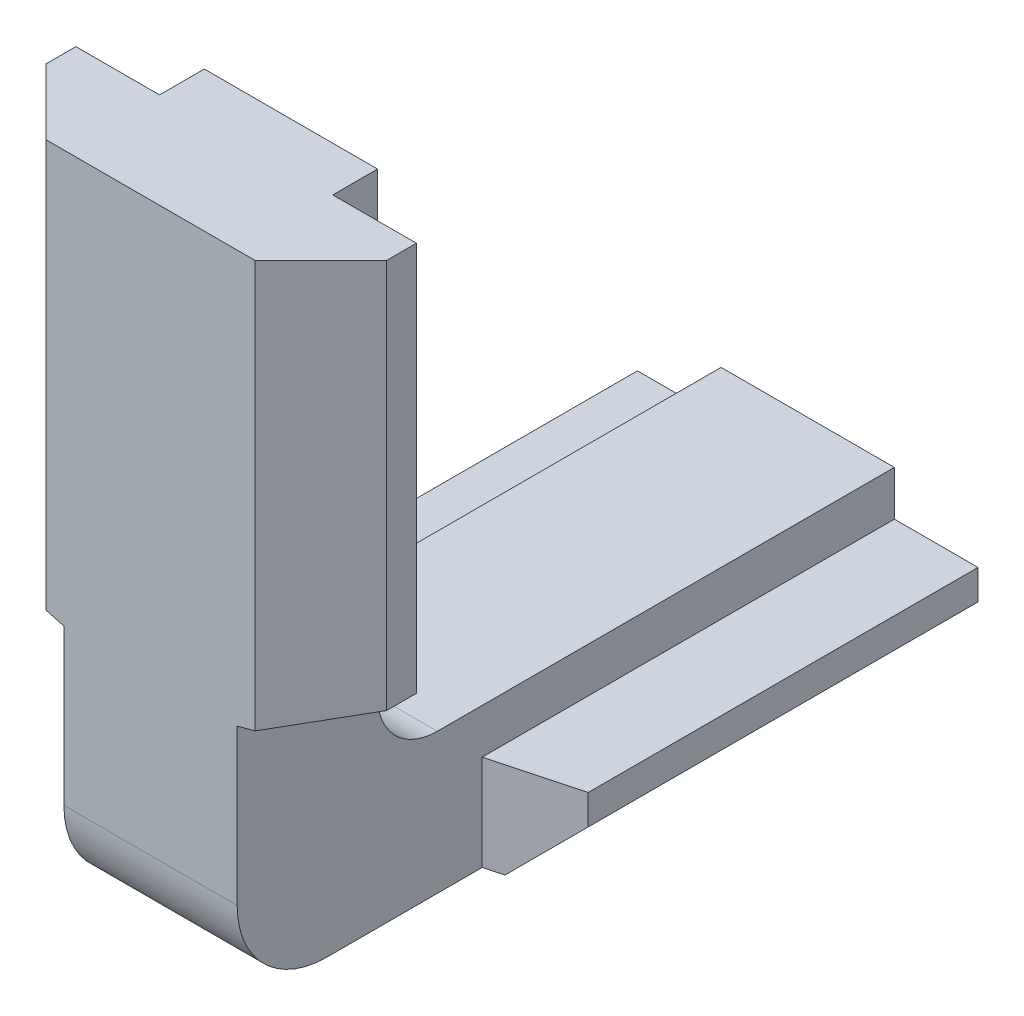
ISO-10303-21;
HEADER;
FILE_DESCRIPTION(('STEP AP214'),'2;1');
FILE_NAME('part.step','',(''),(''),'','','');
FILE_SCHEMA(('AUTOMOTIVE_DESIGN { 1 0 10303 214 1 1 1 1 }'));
ENDSEC;
DATA;
#1=APPLICATION_CONTEXT('core data for automotive mechanical design processes');
#2=APPLICATION_PROTOCOL_DEFINITION('international standard','automotive_design',2000,#1);
#3=PRODUCT_CONTEXT('',#1,'mechanical');
#4=PRODUCT('Part','Part','',(#3));
#5=PRODUCT_RELATED_PRODUCT_CATEGORY('part','',(#4));
#6=PRODUCT_DEFINITION_FORMATION('','',#4);
#7=PRODUCT_DEFINITION_CONTEXT('part definition',#1,'design');
#8=PRODUCT_DEFINITION('design','',#6,#7);
#9=PRODUCT_DEFINITION_SHAPE('','',#8);
#10=(LENGTH_UNIT() NAMED_UNIT(*) SI_UNIT(.MILLI.,.METRE.));
#11=(NAMED_UNIT(*) PLANE_ANGLE_UNIT() SI_UNIT($,.RADIAN.));
#12=(NAMED_UNIT(*) SI_UNIT($,.STERADIAN.) SOLID_ANGLE_UNIT());
#13=UNCERTAINTY_MEASURE_WITH_UNIT(LENGTH_MEASURE(1.E-05),#10,'distance_accuracy_value','');
#14=(GEOMETRIC_REPRESENTATION_CONTEXT(3) GLOBAL_UNCERTAINTY_ASSIGNED_CONTEXT((#13)) GLOBAL_UNIT_ASSIGNED_CONTEXT((#10,
#11,#12)) REPRESENTATION_CONTEXT('',''));
#15=CARTESIAN_POINT('',(0.,0.,0.));
#16=DIRECTION('',(0.,0.,1.));
#17=DIRECTION('',(1.,0.,0.));
#18=AXIS2_PLACEMENT_3D('',#15,#16,#17);
#19=CARTESIAN_POINT('',(5.7,-2.5,-17.3));
#20=DIRECTION('',(1.,0.,0.));
#21=DIRECTION('',(0.,0.,-1.));
#22=AXIS2_PLACEMENT_3D('',#19,#20,#21);
#23=PLANE('',#22);
#24=DIRECTION('',(0.,1.,0.));
#25=VECTOR('',#24,1.);
#26=CARTESIAN_POINT('',(5.7,0.,-17.3));
#27=LINE('',#26,#25);
#28=CARTESIAN_POINT('',(5.7,-2.5,-17.3));
#29=VERTEX_POINT('',#28);
#30=CARTESIAN_POINT('',(5.7,-1.5,-17.3));
#31=VERTEX_POINT('',#30);
#32=EDGE_CURVE('E360',#29,#31,#27,.T.);
#33=ORIENTED_EDGE('',*,*,#32,.T.);
#34=DIRECTION('',(0.,0.,1.));
#35=VECTOR('',#34,1.);
#36=CARTESIAN_POINT('',(5.7,-1.5,-17.3));
#37=LINE('',#36,#35);
#38=CARTESIAN_POINT('',(5.7,-1.5,-4.25026));
#39=VERTEX_POINT('',#38);
#40=EDGE_CURVE('E430',#39,#31,#37,.F.);
#41=ORIENTED_EDGE('',*,*,#40,.F.);
#42=DIRECTION('',(0.,1.,0.));
#43=VECTOR('',#42,1.);
#44=CARTESIAN_POINT('',(5.7,-1.5,-4.25026));
#45=LINE('',#44,#43);
#46=CARTESIAN_POINT('',(5.7,-2.5,-4.25026));
#47=VERTEX_POINT('',#46);
#48=EDGE_CURVE('E350',#39,#47,#45,.F.);
#49=ORIENTED_EDGE('',*,*,#48,.T.);
#50=DIRECTION('',(0.,0.,1.));
#51=VECTOR('',#50,1.);
#52=CARTESIAN_POINT('',(5.7,-2.5,-17.3));
#53=LINE('',#52,#51);
#54=EDGE_CURVE('E421',#29,#47,#53,.T.);
#55=ORIENTED_EDGE('',*,*,#54,.F.);
#56=EDGE_LOOP('',(#33,#41,#49,#55));
#57=FACE_BOUND('',#56,.T.);
#58=ADVANCED_FACE('F16',(#57),#23,.T.);
#59=CARTESIAN_POINT('',(-5.7,-1.5,-17.3));
#60=DIRECTION('',(-1.,0.,0.));
#61=DIRECTION('',(0.,0.,1.));
#62=AXIS2_PLACEMENT_3D('',#59,#60,#61);
#63=PLANE('',#62);
#64=DIRECTION('',(0.,1.,0.));
#65=VECTOR('',#64,1.);
#66=CARTESIAN_POINT('',(-5.7,0.,-17.3));
#67=LINE('',#66,#65);
#68=CARTESIAN_POINT('',(-5.7,-1.5,-17.3));
#69=VERTEX_POINT('',#68);
#70=CARTESIAN_POINT('',(-5.7,-2.5,-17.3));
#71=VERTEX_POINT('',#70);
#72=EDGE_CURVE('E162',#69,#71,#67,.F.);
#73=ORIENTED_EDGE('',*,*,#72,.T.);
#74=DIRECTION('',(0.,0.,1.));
#75=VECTOR('',#74,1.);
#76=CARTESIAN_POINT('',(-5.7,-2.5,-17.3));
#77=LINE('',#76,#75);
#78=CARTESIAN_POINT('',(-5.7,-2.5,-4.25026000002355));
#79=VERTEX_POINT('',#78);
#80=EDGE_CURVE('E357',#79,#71,#77,.F.);
#81=ORIENTED_EDGE('',*,*,#80,.F.);
#82=DIRECTION('',(0.,1.,0.));
#83=VECTOR('',#82,1.);
#84=CARTESIAN_POINT('',(-5.7,-1.5,-4.25026000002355));
#85=LINE('',#84,#83);
#86=CARTESIAN_POINT('',(-5.7,-1.5,-4.25026000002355));
#87=VERTEX_POINT('',#86);
#88=EDGE_CURVE('E361',#79,#87,#85,.T.);
#89=ORIENTED_EDGE('',*,*,#88,.T.);
#90=DIRECTION('',(0.,0.,1.));
#91=VECTOR('',#90,1.);
#92=CARTESIAN_POINT('',(-5.7,-1.5,-17.3));
#93=LINE('',#92,#91);
#94=EDGE_CURVE('E244',#69,#87,#93,.T.);
#95=ORIENTED_EDGE('',*,*,#94,.F.);
#96=EDGE_LOOP('',(#73,#81,#89,#95));
#97=FACE_BOUND('',#96,.T.);
#98=ADVANCED_FACE('F597',(#97),#63,.T.);
#99=CARTESIAN_POINT('',(-5.7,-2.5,-17.3));
#100=DIRECTION('',(-0.707106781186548,-0.707106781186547,0.));
#101=DIRECTION('',(0.707106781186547,-0.707106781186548,0.));
#102=AXIS2_PLACEMENT_3D('',#99,#100,#101);
#103=PLANE('',#102);
#104=DIRECTION('',(0.707106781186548,-0.707106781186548,0.));
#105=VECTOR('',#104,1.);
#106=CARTESIAN_POINT('',(-5.7,-2.5,-17.3));
#107=LINE('',#106,#105);
#108=CARTESIAN_POINT('',(-3.5,-4.7,-17.3));
#109=VERTEX_POINT('',#108);
#110=EDGE_CURVE('E374',#71,#109,#107,.T.);
#111=ORIENTED_EDGE('',*,*,#110,.T.);
#112=DIRECTION('',(0.,0.,-1.));
#113=VECTOR('',#112,1.);
#114=CARTESIAN_POINT('',(-3.5,-4.7,-17.3));
#115=LINE('',#114,#113);
#116=CARTESIAN_POINT('',(-3.5,-4.7,-3.66077000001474));
#117=VERTEX_POINT('',#116);
#118=EDGE_CURVE('E232',#117,#109,#115,.T.);
#119=ORIENTED_EDGE('',*,*,#118,.F.);
#120=DIRECTION('',(-0.694746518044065,0.694746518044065,-0.186157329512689));
#121=VECTOR('',#120,1.);
#122=CARTESIAN_POINT('',(-3.5,-4.7,-3.66077000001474));
#123=LINE('',#122,#121);
#124=EDGE_CURVE('E243',#117,#79,#123,.T.);
#125=ORIENTED_EDGE('',*,*,#124,.T.);
#126=ORIENTED_EDGE('',*,*,#80,.T.);
#127=EDGE_LOOP('',(#111,#119,#125,#126));
#128=FACE_BOUND('',#127,.T.);
#129=ADVANCED_FACE('F595',(#128),#103,.T.);
#130=CARTESIAN_POINT('',(0.,0.,-17.3));
#131=DIRECTION('',(0.,0.,1.));
#132=DIRECTION('',(1.,0.,0.));
#133=AXIS2_PLACEMENT_3D('',#130,#131,#132);
#134=PLANE('',#133);
#135=ORIENTED_EDGE('',*,*,#110,.F.);
#136=ORIENTED_EDGE('',*,*,#72,.F.);
#137=DIRECTION('',(1.,0.,0.));
#138=VECTOR('',#137,1.);
#139=CARTESIAN_POINT('',(-2.9,-1.5,-17.3));
#140=LINE('',#139,#138);
#141=CARTESIAN_POINT('',(-2.9,-1.5,-17.3));
#142=VERTEX_POINT('',#141);
#143=EDGE_CURVE('E160',#142,#69,#140,.F.);
#144=ORIENTED_EDGE('',*,*,#143,.F.);
#145=DIRECTION('',(0.,1.,0.));
#146=VECTOR('',#145,1.);
#147=CARTESIAN_POINT('',(-2.9,0.,-17.3));
#148=LINE('',#147,#146);
#149=CARTESIAN_POINT('',(-2.9,0.,-17.3));
#150=VERTEX_POINT('',#149);
#151=EDGE_CURVE('E150',#150,#142,#148,.F.);
#152=ORIENTED_EDGE('',*,*,#151,.F.);
#153=DIRECTION('',(1.,0.,0.));
#154=VECTOR('',#153,1.);
#155=CARTESIAN_POINT('',(2.9,0.,-17.3));
#156=LINE('',#155,#154);
#157=CARTESIAN_POINT('',(2.9,0.,-17.3));
#158=VERTEX_POINT('',#157);
#159=EDGE_CURVE('E158',#158,#150,#156,.F.);
#160=ORIENTED_EDGE('',*,*,#159,.F.);
#161=DIRECTION('',(0.,1.,0.));
#162=VECTOR('',#161,1.);
#163=CARTESIAN_POINT('',(2.9,0.,-17.3));
#164=LINE('',#163,#162);
#165=CARTESIAN_POINT('',(2.9,-1.5,-17.3));
#166=VERTEX_POINT('',#165);
#167=EDGE_CURVE('E71',#166,#158,#164,.T.);
#168=ORIENTED_EDGE('',*,*,#167,.F.);
#169=DIRECTION('',(1.,0.,0.));
#170=VECTOR('',#169,1.);
#171=CARTESIAN_POINT('',(5.7,-1.5,-17.3));
#172=LINE('',#171,#170);
#173=EDGE_CURVE('E402',#31,#166,#172,.F.);
#174=ORIENTED_EDGE('',*,*,#173,.F.);
#175=ORIENTED_EDGE('',*,*,#32,.F.);
#176=DIRECTION('',(0.707106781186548,0.707106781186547,0.));
#177=VECTOR('',#176,1.);
#178=CARTESIAN_POINT('',(3.5,-4.7,-17.3));
#179=LINE('',#178,#177);
#180=CARTESIAN_POINT('',(3.5,-4.7,-17.3));
#181=VERTEX_POINT('',#180);
#182=EDGE_CURVE('E424',#181,#29,#179,.T.);
#183=ORIENTED_EDGE('',*,*,#182,.F.);
#184=DIRECTION('',(1.,0.,0.));
#185=VECTOR('',#184,1.);
#186=CARTESIAN_POINT('',(-3.5,-4.7,-17.3));
#187=LINE('',#186,#185);
#188=EDGE_CURVE('E344',#109,#181,#187,.T.);
#189=ORIENTED_EDGE('',*,*,#188,.F.);
#190=EDGE_LOOP('',(#135,#136,#144,#152,#160,#168,#174,#175,#183,#189));
#191=FACE_BOUND('',#190,.T.);
#192=ADVANCED_FACE('F157',(#191),#134,.F.);
#193=CARTESIAN_POINT('',(3.5,-4.7,-17.3));
#194=DIRECTION('',(0.707106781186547,-0.707106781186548,0.));
#195=DIRECTION('',(0.707106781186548,0.707106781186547,0.));
#196=AXIS2_PLACEMENT_3D('',#193,#194,#195);
#197=PLANE('',#196);
#198=ORIENTED_EDGE('',*,*,#182,.T.);
#199=ORIENTED_EDGE('',*,*,#54,.T.);
#200=DIRECTION('',(-0.694746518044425,-0.694746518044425,0.186157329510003));
#201=VECTOR('',#200,1.);
#202=CARTESIAN_POINT('',(5.7,-2.5,-4.25026));
#203=LINE('',#202,#201);
#204=CARTESIAN_POINT('',(3.5,-4.7,-3.66077));
#205=VERTEX_POINT('',#204);
#206=EDGE_CURVE('E347',#47,#205,#203,.T.);
#207=ORIENTED_EDGE('',*,*,#206,.T.);
#208=DIRECTION('',(0.,0.,-1.));
#209=VECTOR('',#208,1.);
#210=CARTESIAN_POINT('',(3.5,-4.7,-17.3));
#211=LINE('',#210,#209);
#212=EDGE_CURVE('E213',#181,#205,#211,.F.);
#213=ORIENTED_EDGE('',*,*,#212,.F.);
#214=EDGE_LOOP('',(#198,#199,#207,#213));
#215=FACE_BOUND('',#214,.T.);
#216=ADVANCED_FACE('F588',(#215),#197,.T.);
#217=CARTESIAN_POINT('',(5.7,-1.5,-4.25026));
#218=DIRECTION('',(-0.258819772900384,0.,-0.965925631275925));
#219=DIRECTION('',(-0.965925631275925,0.,0.258819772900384));
#220=AXIS2_PLACEMENT_3D('',#217,#218,#219);
#221=PLANE('',#220);
#222=ORIENTED_EDGE('',*,*,#206,.F.);
#223=ORIENTED_EDGE('',*,*,#48,.F.);
#224=DIRECTION('',(0.965925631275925,0.,-0.258819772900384));
#225=VECTOR('',#224,1.);
#226=CARTESIAN_POINT('',(2.9,-1.5,-3.5));
#227=LINE('',#226,#225);
#228=CARTESIAN_POINT('',(2.9,-1.5,-3.5));
#229=VERTEX_POINT('',#228);
#230=EDGE_CURVE('E349',#229,#39,#227,.T.);
#231=ORIENTED_EDGE('',*,*,#230,.F.);
#232=DIRECTION('',(0.,1.,0.));
#233=VECTOR('',#232,1.);
#234=CARTESIAN_POINT('',(2.9,-1.5,-3.5));
#235=LINE('',#234,#233);
#236=CARTESIAN_POINT('',(2.9,-4.7,-3.5));
#237=VERTEX_POINT('',#236);
#238=EDGE_CURVE('E212',#237,#229,#235,.T.);
#239=ORIENTED_EDGE('',*,*,#238,.F.);
#240=DIRECTION('',(-0.965925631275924,0.,0.258819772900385));
#241=VECTOR('',#240,1.);
#242=CARTESIAN_POINT('',(3.5,-4.7,-3.66077));
#243=LINE('',#242,#241);
#244=EDGE_CURVE('E233',#205,#237,#243,.T.);
#245=ORIENTED_EDGE('',*,*,#244,.F.);
#246=EDGE_LOOP('',(#222,#223,#231,#239,#245));
#247=FACE_BOUND('',#246,.T.);
#248=ADVANCED_FACE('F584',(#247),#221,.F.);
#249=CARTESIAN_POINT('',(5.7,-1.5,-17.3));
#250=DIRECTION('',(0.,1.,0.));
#251=DIRECTION('',(0.,0.,1.));
#252=AXIS2_PLACEMENT_3D('',#249,#250,#251);
#253=PLANE('',#252);
#254=ORIENTED_EDGE('',*,*,#173,.T.);
#255=DIRECTION('',(0.,0.,-1.));
#256=VECTOR('',#255,1.);
#257=CARTESIAN_POINT('',(2.9,-1.5,-17.3));
#258=LINE('',#257,#256);
#259=EDGE_CURVE('E208',#229,#166,#258,.T.);
#260=ORIENTED_EDGE('',*,*,#259,.F.);
#261=ORIENTED_EDGE('',*,*,#230,.T.);
#262=ORIENTED_EDGE('',*,*,#40,.T.);
#263=EDGE_LOOP('',(#254,#260,#261,#262));
#264=FACE_BOUND('',#263,.T.);
#265=ADVANCED_FACE('F581',(#264),#253,.T.);
#266=CARTESIAN_POINT('',(5.7,-2.5,-17.3));
#267=DIRECTION('',(1.,0.,0.));
#268=DIRECTION('',(0.,0.,-1.));
#269=AXIS2_PLACEMENT_3D('',#266,#267,#268);
#270=PLANE('',#269);
#271=DIRECTION('',(0.,1.,0.));
#272=VECTOR('',#271,1.);
#273=CARTESIAN_POINT('',(5.7,-4.7,2.5));
#274=LINE('',#273,#272);
#275=CARTESIAN_POINT('',(5.7,4.25025773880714,2.5));
#276=VERTEX_POINT('',#275);
#277=CARTESIAN_POINT('',(5.7,17.3,2.5));
#278=VERTEX_POINT('',#277);
#279=EDGE_CURVE('E223',#276,#278,#274,.T.);
#280=ORIENTED_EDGE('',*,*,#279,.F.);
#281=DIRECTION('',(0.,0.,1.));
#282=VECTOR('',#281,1.);
#283=CARTESIAN_POINT('',(5.7,4.25025773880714,0.));
#284=LINE('',#283,#282);
#285=CARTESIAN_POINT('',(5.70000000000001,4.25025773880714,1.5));
#286=VERTEX_POINT('',#285);
#287=EDGE_CURVE('E314',#276,#286,#284,.F.);
#288=ORIENTED_EDGE('',*,*,#287,.T.);
#289=DIRECTION('',(0.,1.,0.));
#290=VECTOR('',#289,1.);
#291=CARTESIAN_POINT('',(5.70000000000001,-4.7,1.5));
#292=LINE('',#291,#290);
#293=CARTESIAN_POINT('',(5.70000000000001,17.3,1.5));
#294=VERTEX_POINT('',#293);
#295=EDGE_CURVE('E324',#294,#286,#292,.F.);
#296=ORIENTED_EDGE('',*,*,#295,.F.);
#297=DIRECTION('',(0.,0.,-1.));
#298=VECTOR('',#297,1.);
#299=CARTESIAN_POINT('',(5.7,17.3,-17.3));
#300=LINE('',#299,#298);
#301=EDGE_CURVE('E315',#294,#278,#300,.F.);
#302=ORIENTED_EDGE('',*,*,#301,.T.);
#303=EDGE_LOOP('',(#280,#288,#296,#302));
#304=FACE_BOUND('',#303,.T.);
#305=ADVANCED_FACE('F514',(#304),#270,.T.);
#306=CARTESIAN_POINT('',(2.9,3.5,0.));
#307=DIRECTION('',(-0.258819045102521,0.965925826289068,0.));
#308=DIRECTION('',(-0.965925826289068,-0.258819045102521,0.));
#309=AXIS2_PLACEMENT_3D('',#306,#307,#308);
#310=PLANE('',#309);
#311=DIRECTION('',(-0.965925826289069,-0.258819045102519,0.));
#312=VECTOR('',#311,1.);
#313=CARTESIAN_POINT('',(5.7,4.25025773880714,1.5));
#314=LINE('',#313,#312);
#315=CARTESIAN_POINT('',(2.9,3.5,1.5));
#316=VERTEX_POINT('',#315);
#317=EDGE_CURVE('E285',#286,#316,#314,.T.);
#318=ORIENTED_EDGE('',*,*,#317,.F.);
#319=ORIENTED_EDGE('',*,*,#287,.F.);
#320=DIRECTION('',(0.694746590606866,0.186156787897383,-0.694746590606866));
#321=VECTOR('',#320,1.);
#322=CARTESIAN_POINT('',(3.5,3.66076951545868,4.7));
#323=LINE('',#322,#321);
#324=CARTESIAN_POINT('',(3.5,3.66076951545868,4.7));
#325=VERTEX_POINT('',#324);
#326=EDGE_CURVE('E299',#325,#276,#323,.T.);
#327=ORIENTED_EDGE('',*,*,#326,.F.);
#328=DIRECTION('',(-0.965925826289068,-0.258819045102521,0.));
#329=VECTOR('',#328,1.);
#330=CARTESIAN_POINT('',(2.9,3.5,4.7));
#331=LINE('',#330,#329);
#332=CARTESIAN_POINT('',(2.9,3.5,4.7));
#333=VERTEX_POINT('',#332);
#334=EDGE_CURVE('E117',#333,#325,#331,.F.);
#335=ORIENTED_EDGE('',*,*,#334,.F.);
#336=DIRECTION('',(0.,0.,-1.));
#337=VECTOR('',#336,1.);
#338=CARTESIAN_POINT('',(2.9,3.5,-17.3));
#339=LINE('',#338,#337);
#340=EDGE_CURVE('E221',#316,#333,#339,.F.);
#341=ORIENTED_EDGE('',*,*,#340,.F.);
#342=EDGE_LOOP('',(#318,#319,#327,#335,#341));
#343=FACE_BOUND('',#342,.T.);
#344=ADVANCED_FACE('F517',(#343),#310,.F.);
#345=CARTESIAN_POINT('',(2.9,-4.7,1.5));
#346=DIRECTION('',(0.,0.,-1.));
#347=DIRECTION('',(-1.,0.,0.));
#348=AXIS2_PLACEMENT_3D('',#345,#346,#347);
#349=PLANE('',#348);
#350=ORIENTED_EDGE('',*,*,#295,.T.);
#351=ORIENTED_EDGE('',*,*,#317,.T.);
#352=DIRECTION('',(0.,1.,0.));
#353=VECTOR('',#352,1.);
#354=CARTESIAN_POINT('',(2.9,-1.5,1.5));
#355=LINE('',#354,#353);
#356=CARTESIAN_POINT('',(2.9,17.3,1.5));
#357=VERTEX_POINT('',#356);
#358=EDGE_CURVE('E204',#357,#316,#355,.F.);
#359=ORIENTED_EDGE('',*,*,#358,.F.);
#360=DIRECTION('',(1.,0.,0.));
#361=VECTOR('',#360,1.);
#362=CARTESIAN_POINT('',(-3.5,17.3,1.5));
#363=LINE('',#362,#361);
#364=EDGE_CURVE('E290',#357,#294,#363,.T.);
#365=ORIENTED_EDGE('',*,*,#364,.T.);
#366=EDGE_LOOP('',(#350,#351,#359,#365));
#367=FACE_BOUND('',#366,.T.);
#368=ADVANCED_FACE('F568',(#367),#349,.T.);
#369=CARTESIAN_POINT('',(-5.7,-1.5,-17.3));
#370=DIRECTION('',(-1.,0.,0.));
#371=DIRECTION('',(0.,0.,1.));
#372=AXIS2_PLACEMENT_3D('',#369,#370,#371);
#373=PLANE('',#372);
#374=DIRECTION('',(0.,1.,0.));
#375=VECTOR('',#374,1.);
#376=CARTESIAN_POINT('',(-5.7,-4.69999999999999,1.5));
#377=LINE('',#376,#375);
#378=CARTESIAN_POINT('',(-5.7,4.25025773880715,1.5));
#379=VERTEX_POINT('',#378);
#380=CARTESIAN_POINT('',(-5.7,17.3,1.5));
#381=VERTEX_POINT('',#380);
#382=EDGE_CURVE('E279',#379,#381,#377,.T.);
#383=ORIENTED_EDGE('',*,*,#382,.F.);
#384=DIRECTION('',(0.,0.,1.));
#385=VECTOR('',#384,1.);
#386=CARTESIAN_POINT('',(-5.7,4.25025773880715,0.));
#387=LINE('',#386,#385);
#388=CARTESIAN_POINT('',(-5.7,4.25025773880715,2.5));
#389=VERTEX_POINT('',#388);
#390=EDGE_CURVE('E284',#379,#389,#387,.T.);
#391=ORIENTED_EDGE('',*,*,#390,.T.);
#392=DIRECTION('',(0.,1.,0.));
#393=VECTOR('',#392,1.);
#394=CARTESIAN_POINT('',(-5.7,-4.69999999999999,2.5));
#395=LINE('',#394,#393);
#396=CARTESIAN_POINT('',(-5.7,17.3,2.5));
#397=VERTEX_POINT('',#396);
#398=EDGE_CURVE('E302',#397,#389,#395,.F.);
#399=ORIENTED_EDGE('',*,*,#398,.F.);
#400=DIRECTION('',(0.,0.,-1.));
#401=VECTOR('',#400,1.);
#402=CARTESIAN_POINT('',(-5.7,17.3,-17.3));
#403=LINE('',#402,#401);
#404=EDGE_CURVE('E270',#397,#381,#403,.T.);
#405=ORIENTED_EDGE('',*,*,#404,.T.);
#406=EDGE_LOOP('',(#383,#391,#399,#405));
#407=FACE_BOUND('',#406,.T.);
#408=ADVANCED_FACE('F548',(#407),#373,.T.);
#409=CARTESIAN_POINT('',(-10.,5.40243926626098,0.));
#410=DIRECTION('',(0.258819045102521,0.965925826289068,0.));
#411=DIRECTION('',(-0.965925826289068,0.258819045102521,0.));
#412=AXIS2_PLACEMENT_3D('',#409,#410,#411);
#413=PLANE('',#412);
#414=ORIENTED_EDGE('',*,*,#390,.F.);
#415=DIRECTION('',(-0.965925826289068,0.258819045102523,0.));
#416=VECTOR('',#415,1.);
#417=CARTESIAN_POINT('',(-2.9,3.5,1.5));
#418=LINE('',#417,#416);
#419=CARTESIAN_POINT('',(-2.9,3.5,1.5));
#420=VERTEX_POINT('',#419);
#421=EDGE_CURVE('E256',#420,#379,#418,.T.);
#422=ORIENTED_EDGE('',*,*,#421,.F.);
#423=DIRECTION('',(0.,0.,1.));
#424=VECTOR('',#423,1.);
#425=CARTESIAN_POINT('',(-2.9,3.5,-17.3));
#426=LINE('',#425,#424);
#427=CARTESIAN_POINT('',(-2.9,3.5,4.7));
#428=VERTEX_POINT('',#427);
#429=EDGE_CURVE('E194',#428,#420,#426,.F.);
#430=ORIENTED_EDGE('',*,*,#429,.F.);
#431=DIRECTION('',(-0.965925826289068,0.258819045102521,0.));
#432=VECTOR('',#431,1.);
#433=CARTESIAN_POINT('',(-10.,5.40243926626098,4.7));
#434=LINE('',#433,#432);
#435=CARTESIAN_POINT('',(-3.5,3.66076951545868,4.7));
#436=VERTEX_POINT('',#435);
#437=EDGE_CURVE('E282',#436,#428,#434,.F.);
#438=ORIENTED_EDGE('',*,*,#437,.F.);
#439=DIRECTION('',(0.694746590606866,-0.186156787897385,0.694746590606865));
#440=VECTOR('',#439,1.);
#441=CARTESIAN_POINT('',(-5.7,4.25025773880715,2.5));
#442=LINE('',#441,#440);
#443=EDGE_CURVE('E198',#389,#436,#442,.T.);
#444=ORIENTED_EDGE('',*,*,#443,.F.);
#445=EDGE_LOOP('',(#414,#422,#430,#438,#444));
#446=FACE_BOUND('',#445,.T.);
#447=ADVANCED_FACE('F551',(#446),#413,.F.);
#448=CARTESIAN_POINT('',(-5.7,-4.69999999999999,1.5));
#449=DIRECTION('',(0.,0.,-1.));
#450=DIRECTION('',(-1.,0.,0.));
#451=AXIS2_PLACEMENT_3D('',#448,#449,#450);
#452=PLANE('',#451);
#453=DIRECTION('',(0.,1.,0.));
#454=VECTOR('',#453,1.);
#455=CARTESIAN_POINT('',(-2.9,0.,1.5));
#456=LINE('',#455,#454);
#457=CARTESIAN_POINT('',(-2.9,17.3,1.5));
#458=VERTEX_POINT('',#457);
#459=EDGE_CURVE('E197',#420,#458,#456,.T.);
#460=ORIENTED_EDGE('',*,*,#459,.F.);
#461=ORIENTED_EDGE('',*,*,#421,.T.);
#462=ORIENTED_EDGE('',*,*,#382,.T.);
#463=DIRECTION('',(1.,0.,0.));
#464=VECTOR('',#463,1.);
#465=CARTESIAN_POINT('',(-3.5,17.3,1.5));
#466=LINE('',#465,#464);
#467=EDGE_CURVE('E265',#381,#458,#466,.T.);
#468=ORIENTED_EDGE('',*,*,#467,.T.);
#469=EDGE_LOOP('',(#460,#461,#462,#468));
#470=FACE_BOUND('',#469,.T.);
#471=ADVANCED_FACE('F556',(#470),#452,.T.);
#472=CARTESIAN_POINT('',(-2.9,-4.69999999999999,0.));
#473=DIRECTION('',(0.,0.,-1.));
#474=DIRECTION('',(-1.,0.,0.));
#475=AXIS2_PLACEMENT_3D('',#472,#473,#474);
#476=PLANE('',#475);
#477=DIRECTION('',(0.,1.,0.));
#478=VECTOR('',#477,1.);
#479=CARTESIAN_POINT('',(2.9,-1.5,0.));
#480=LINE('',#479,#478);
#481=CARTESIAN_POINT('',(2.9,2.,0.));
#482=VERTEX_POINT('',#481);
#483=CARTESIAN_POINT('',(2.90000000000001,17.3,0.));
#484=VERTEX_POINT('',#483);
#485=EDGE_CURVE('E201',#482,#484,#480,.T.);
#486=ORIENTED_EDGE('',*,*,#485,.F.);
#487=DIRECTION('',(1.,0.,0.));
#488=VECTOR('',#487,1.);
#489=CARTESIAN_POINT('',(2.95340695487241,2.,0.));
#490=LINE('',#489,#488);
#491=CARTESIAN_POINT('',(-2.9,2.,0.));
#492=VERTEX_POINT('',#491);
#493=EDGE_CURVE('E168',#482,#492,#490,.F.);
#494=ORIENTED_EDGE('',*,*,#493,.T.);
#495=DIRECTION('',(0.,1.,0.));
#496=VECTOR('',#495,1.);
#497=CARTESIAN_POINT('',(-2.9,0.,0.));
#498=LINE('',#497,#496);
#499=CARTESIAN_POINT('',(-2.9,17.3,0.));
#500=VERTEX_POINT('',#499);
#501=EDGE_CURVE('E178',#500,#492,#498,.F.);
#502=ORIENTED_EDGE('',*,*,#501,.F.);
#503=DIRECTION('',(1.,0.,0.));
#504=VECTOR('',#503,1.);
#505=CARTESIAN_POINT('',(-3.5,17.3,0.));
#506=LINE('',#505,#504);
#507=EDGE_CURVE('E261',#500,#484,#506,.T.);
#508=ORIENTED_EDGE('',*,*,#507,.T.);
#509=EDGE_LOOP('',(#486,#494,#502,#508));
#510=FACE_BOUND('',#509,.T.);
#511=ADVANCED_FACE('F563',(#510),#476,.T.);
#512=CARTESIAN_POINT('',(2.95340695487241,2.,-2.));
#513=DIRECTION('',(1.,0.,0.));
#514=DIRECTION('',(0.,1.,0.));
#515=AXIS2_PLACEMENT_3D('',#512,#513,#514);
#516=CYLINDRICAL_SURFACE('',#515,2.);
#517=ORIENTED_EDGE('',*,*,#493,.F.);
#518=CARTESIAN_POINT('',(2.9,2.,-2.));
#519=DIRECTION('',(1.,0.,0.));
#520=DIRECTION('',(0.,1.,0.));
#521=AXIS2_PLACEMENT_3D('',#518,#519,#520);
#522=CIRCLE('',#521,2.);
#523=CARTESIAN_POINT('',(2.9,0.,-2.));
#524=VERTEX_POINT('',#523);
#525=EDGE_CURVE('E19',#524,#482,#522,.F.);
#526=ORIENTED_EDGE('',*,*,#525,.F.);
#527=DIRECTION('',(1.,0.,0.));
#528=VECTOR('',#527,1.);
#529=CARTESIAN_POINT('',(2.9,0.,-2.));
#530=LINE('',#529,#528);
#531=CARTESIAN_POINT('',(-2.9,0.,-2.));
#532=VERTEX_POINT('',#531);
#533=EDGE_CURVE('E60',#532,#524,#530,.T.);
#534=ORIENTED_EDGE('',*,*,#533,.F.);
#535=CARTESIAN_POINT('',(-2.9,2.,-2.));
#536=DIRECTION('',(1.,0.,0.));
#537=DIRECTION('',(0.,1.,0.));
#538=AXIS2_PLACEMENT_3D('',#535,#536,#537);
#539=CIRCLE('',#538,2.);
#540=EDGE_CURVE('E173',#492,#532,#539,.T.);
#541=ORIENTED_EDGE('',*,*,#540,.F.);
#542=EDGE_LOOP('',(#517,#526,#534,#541));
#543=FACE_BOUND('',#542,.T.);
#544=ADVANCED_FACE('F566',(#543),#516,.F.);
#545=CARTESIAN_POINT('',(2.9,0.,-17.3));
#546=DIRECTION('',(0.,1.,0.));
#547=DIRECTION('',(0.,0.,1.));
#548=AXIS2_PLACEMENT_3D('',#545,#546,#547);
#549=PLANE('',#548);
#550=DIRECTION('',(0.,0.,1.));
#551=VECTOR('',#550,1.);
#552=CARTESIAN_POINT('',(-2.9,0.,-17.3));
#553=LINE('',#552,#551);
#554=EDGE_CURVE('E165',#532,#150,#553,.F.);
#555=ORIENTED_EDGE('',*,*,#554,.F.);
#556=ORIENTED_EDGE('',*,*,#533,.T.);
#557=DIRECTION('',(0.,0.,-1.));
#558=VECTOR('',#557,1.);
#559=CARTESIAN_POINT('',(2.9,0.,-17.3));
#560=LINE('',#559,#558);
#561=EDGE_CURVE('E167',#158,#524,#560,.F.);
#562=ORIENTED_EDGE('',*,*,#561,.F.);
#563=ORIENTED_EDGE('',*,*,#159,.T.);
#564=EDGE_LOOP('',(#555,#556,#562,#563));
#565=FACE_BOUND('',#564,.T.);
#566=ADVANCED_FACE('F164',(#565),#549,.T.);
#567=CARTESIAN_POINT('',(-2.9,-1.5,-17.3));
#568=DIRECTION('',(0.,1.,0.));
#569=DIRECTION('',(0.,0.,1.));
#570=AXIS2_PLACEMENT_3D('',#567,#568,#569);
#571=PLANE('',#570);
#572=ORIENTED_EDGE('',*,*,#143,.T.);
#573=ORIENTED_EDGE('',*,*,#94,.T.);
#574=DIRECTION('',(-0.965925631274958,0.,-0.258819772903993));
#575=VECTOR('',#574,1.);
#576=CARTESIAN_POINT('',(-2.8999999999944,-1.5,-3.50000000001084));
#577=LINE('',#576,#575);
#578=CARTESIAN_POINT('',(-2.89999999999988,-1.5,-3.50000000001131));
#579=VERTEX_POINT('',#578);
#580=EDGE_CURVE('E241',#87,#579,#577,.F.);
#581=ORIENTED_EDGE('',*,*,#580,.T.);
#582=DIRECTION('',(0.,0.,1.));
#583=VECTOR('',#582,1.);
#584=CARTESIAN_POINT('',(-2.9,-1.5,-17.3));
#585=LINE('',#584,#583);
#586=EDGE_CURVE('E174',#142,#579,#585,.T.);
#587=ORIENTED_EDGE('',*,*,#586,.F.);
#588=EDGE_LOOP('',(#572,#573,#581,#587));
#589=FACE_BOUND('',#588,.T.);
#590=ADVANCED_FACE('F615',(#589),#571,.T.);
#591=CARTESIAN_POINT('',(-2.8999999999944,-1.5,-3.50000000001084));
#592=DIRECTION('',(0.258819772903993,0.,-0.965925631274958));
#593=DIRECTION('',(-0.965925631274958,0.,-0.258819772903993));
#594=AXIS2_PLACEMENT_3D('',#591,#592,#593);
#595=PLANE('',#594);
#596=DIRECTION('',(-0.965925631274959,0.,-0.258819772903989));
#597=VECTOR('',#596,1.);
#598=CARTESIAN_POINT('',(-2.8999999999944,-4.7,-3.50000000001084));
#599=LINE('',#598,#597);
#600=CARTESIAN_POINT('',(-2.89999999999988,-4.69999999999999,-3.50000000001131));
#601=VERTEX_POINT('',#600);
#602=EDGE_CURVE('E229',#601,#117,#599,.T.);
#603=ORIENTED_EDGE('',*,*,#602,.F.);
#604=DIRECTION('',(0.,1.,0.));
#605=VECTOR('',#604,1.);
#606=CARTESIAN_POINT('',(-2.9,0.,-3.50000000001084));
#607=LINE('',#606,#605);
#608=EDGE_CURVE('E176',#579,#601,#607,.F.);
#609=ORIENTED_EDGE('',*,*,#608,.F.);
#610=ORIENTED_EDGE('',*,*,#580,.F.);
#611=ORIENTED_EDGE('',*,*,#88,.F.);
#612=ORIENTED_EDGE('',*,*,#124,.F.);
#613=EDGE_LOOP('',(#603,#609,#610,#611,#612));
#614=FACE_BOUND('',#613,.T.);
#615=ADVANCED_FACE('F612',(#614),#595,.F.);
#616=CARTESIAN_POINT('',(-3.5,-4.7,-17.3));
#617=DIRECTION('',(0.,-1.,0.));
#618=DIRECTION('',(0.,0.,-1.));
#619=AXIS2_PLACEMENT_3D('',#616,#617,#618);
#620=PLANE('',#619);
#621=ORIENTED_EDGE('',*,*,#188,.T.);
#622=ORIENTED_EDGE('',*,*,#212,.T.);
#623=ORIENTED_EDGE('',*,*,#244,.T.);
#624=DIRECTION('',(0.,0.,-1.));
#625=VECTOR('',#624,1.);
#626=CARTESIAN_POINT('',(2.9,-4.7,-17.3));
#627=LINE('',#626,#625);
#628=CARTESIAN_POINT('',(2.9,-4.7,1.7));
#629=VERTEX_POINT('',#628);
#630=EDGE_CURVE('E102',#629,#237,#627,.T.);
#631=ORIENTED_EDGE('',*,*,#630,.F.);
#632=DIRECTION('',(-1.,0.,0.));
#633=VECTOR('',#632,1.);
#634=CARTESIAN_POINT('',(6.84000000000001,-4.7,1.7));
#635=LINE('',#634,#633);
#636=CARTESIAN_POINT('',(-2.9,-4.7,1.7));
#637=VERTEX_POINT('',#636);
#638=EDGE_CURVE('E226',#637,#629,#635,.F.);
#639=ORIENTED_EDGE('',*,*,#638,.F.);
#640=DIRECTION('',(0.,0.,1.));
#641=VECTOR('',#640,1.);
#642=CARTESIAN_POINT('',(-2.9,-4.69999999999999,-17.3));
#643=LINE('',#642,#641);
#644=EDGE_CURVE('E238',#601,#637,#643,.T.);
#645=ORIENTED_EDGE('',*,*,#644,.F.);
#646=ORIENTED_EDGE('',*,*,#602,.T.);
#647=ORIENTED_EDGE('',*,*,#118,.T.);
#648=EDGE_LOOP('',(#621,#622,#623,#631,#639,#645,#646,#647));
#649=FACE_BOUND('',#648,.T.);
#650=ADVANCED_FACE('F529',(#649),#620,.T.);
#651=CARTESIAN_POINT('',(2.9,-1.5,-17.3));
#652=DIRECTION('',(1.,0.,0.));
#653=DIRECTION('',(0.,0.,-1.));
#654=AXIS2_PLACEMENT_3D('',#651,#652,#653);
#655=PLANE('',#654);
#656=DIRECTION('',(0.,1.,0.));
#657=VECTOR('',#656,1.);
#658=CARTESIAN_POINT('',(2.9,0.,4.7));
#659=LINE('',#658,#657);
#660=CARTESIAN_POINT('',(2.9,-1.69999999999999,4.7));
#661=VERTEX_POINT('',#660);
#662=EDGE_CURVE('E108',#661,#333,#659,.T.);
#663=ORIENTED_EDGE('',*,*,#662,.F.);
#664=CARTESIAN_POINT('',(2.9,-1.7,1.7));
#665=DIRECTION('',(-1.,0.,0.));
#666=DIRECTION('',(0.,0.,1.));
#667=AXIS2_PLACEMENT_3D('',#664,#665,#666);
#668=CIRCLE('',#667,3.);
#669=EDGE_CURVE('E218',#629,#661,#668,.T.);
#670=ORIENTED_EDGE('',*,*,#669,.F.);
#671=ORIENTED_EDGE('',*,*,#630,.T.);
#672=ORIENTED_EDGE('',*,*,#238,.T.);
#673=ORIENTED_EDGE('',*,*,#259,.T.);
#674=ORIENTED_EDGE('',*,*,#167,.T.);
#675=ORIENTED_EDGE('',*,*,#561,.T.);
#676=ORIENTED_EDGE('',*,*,#525,.T.);
#677=ORIENTED_EDGE('',*,*,#485,.T.);
#678=DIRECTION('',(0.,0.,-1.));
#679=VECTOR('',#678,1.);
#680=CARTESIAN_POINT('',(2.90000000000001,17.3,-17.3));
#681=LINE('',#680,#679);
#682=EDGE_CURVE('E264',#484,#357,#681,.F.);
#683=ORIENTED_EDGE('',*,*,#682,.T.);
#684=ORIENTED_EDGE('',*,*,#358,.T.);
#685=ORIENTED_EDGE('',*,*,#340,.T.);
#686=EDGE_LOOP('',(#663,#670,#671,#672,#673,#674,#675,#676,#677,#683,#684,#685));
#687=FACE_BOUND('',#686,.T.);
#688=ADVANCED_FACE('F520',(#687),#655,.T.);
#689=CARTESIAN_POINT('',(5.7,-4.7,2.5));
#690=DIRECTION('',(0.707106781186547,0.,0.707106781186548));
#691=DIRECTION('',(0.707106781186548,0.,-0.707106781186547));
#692=AXIS2_PLACEMENT_3D('',#689,#690,#691);
#693=PLANE('',#692);
#694=DIRECTION('',(0.,1.,0.));
#695=VECTOR('',#694,1.);
#696=CARTESIAN_POINT('',(3.5,0.,4.7));
#697=LINE('',#696,#695);
#698=CARTESIAN_POINT('',(3.5,17.3,4.7));
#699=VERTEX_POINT('',#698);
#700=EDGE_CURVE('E217',#325,#699,#697,.T.);
#701=ORIENTED_EDGE('',*,*,#700,.F.);
#702=ORIENTED_EDGE('',*,*,#326,.T.);
#703=ORIENTED_EDGE('',*,*,#279,.T.);
#704=DIRECTION('',(-0.707106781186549,0.,0.707106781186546));
#705=VECTOR('',#704,1.);
#706=CARTESIAN_POINT('',(5.70000000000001,17.3,2.5));
#707=LINE('',#706,#705);
#708=EDGE_CURVE('E310',#278,#699,#707,.T.);
#709=ORIENTED_EDGE('',*,*,#708,.T.);
#710=EDGE_LOOP('',(#701,#702,#703,#709));
#711=FACE_BOUND('',#710,.T.);
#712=ADVANCED_FACE('F518',(#711),#693,.T.);
#713=CARTESIAN_POINT('',(-3.5,17.3,-17.3));
#714=DIRECTION('',(0.,-1.,0.));
#715=DIRECTION('',(0.,0.,-1.));
#716=AXIS2_PLACEMENT_3D('',#713,#714,#715);
#717=PLANE('',#716);
#718=ORIENTED_EDGE('',*,*,#301,.F.);
#719=ORIENTED_EDGE('',*,*,#364,.F.);
#720=ORIENTED_EDGE('',*,*,#682,.F.);
#721=ORIENTED_EDGE('',*,*,#507,.F.);
#722=DIRECTION('',(0.,0.,1.));
#723=VECTOR('',#722,1.);
#724=CARTESIAN_POINT('',(-2.9,17.3,-17.3));
#725=LINE('',#724,#723);
#726=EDGE_CURVE('E186',#458,#500,#725,.F.);
#727=ORIENTED_EDGE('',*,*,#726,.F.);
#728=ORIENTED_EDGE('',*,*,#467,.F.);
#729=ORIENTED_EDGE('',*,*,#404,.F.);
#730=DIRECTION('',(0.707106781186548,0.,0.707106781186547));
#731=VECTOR('',#730,1.);
#732=CARTESIAN_POINT('',(-3.49999999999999,17.3,4.69999999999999));
#733=LINE('',#732,#731);
#734=CARTESIAN_POINT('',(-3.49999999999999,17.3,4.7));
#735=VERTEX_POINT('',#734);
#736=EDGE_CURVE('E305',#735,#397,#733,.F.);
#737=ORIENTED_EDGE('',*,*,#736,.F.);
#738=DIRECTION('',(1.,0.,0.));
#739=VECTOR('',#738,1.);
#740=CARTESIAN_POINT('',(0.,17.3,4.7));
#741=LINE('',#740,#739);
#742=EDGE_CURVE('E390',#699,#735,#741,.F.);
#743=ORIENTED_EDGE('',*,*,#742,.F.);
#744=ORIENTED_EDGE('',*,*,#708,.F.);
#745=EDGE_LOOP('',(#718,#719,#720,#721,#727,#728,#729,#737,#743,#744));
#746=FACE_BOUND('',#745,.T.);
#747=ADVANCED_FACE('F476',(#746),#717,.F.);
#748=CARTESIAN_POINT('',(-3.5,-4.69999999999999,4.7));
#749=DIRECTION('',(-0.707106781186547,0.,0.707106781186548));
#750=DIRECTION('',(0.707106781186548,0.,0.707106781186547));
#751=AXIS2_PLACEMENT_3D('',#748,#749,#750);
#752=PLANE('',#751);
#753=ORIENTED_EDGE('',*,*,#398,.T.);
#754=ORIENTED_EDGE('',*,*,#443,.T.);
#755=DIRECTION('',(0.,1.,0.));
#756=VECTOR('',#755,1.);
#757=CARTESIAN_POINT('',(-3.49999999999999,0.,4.7));
#758=LINE('',#757,#756);
#759=EDGE_CURVE('E191',#735,#436,#758,.F.);
#760=ORIENTED_EDGE('',*,*,#759,.F.);
#761=ORIENTED_EDGE('',*,*,#736,.T.);
#762=EDGE_LOOP('',(#753,#754,#760,#761));
#763=FACE_BOUND('',#762,.T.);
#764=ADVANCED_FACE('F527',(#763),#752,.T.);
#765=CARTESIAN_POINT('',(-2.9,0.,-17.3));
#766=DIRECTION('',(-1.,0.,0.));
#767=DIRECTION('',(0.,0.,1.));
#768=AXIS2_PLACEMENT_3D('',#765,#766,#767);
#769=PLANE('',#768);
#770=ORIENTED_EDGE('',*,*,#644,.T.);
#771=CARTESIAN_POINT('',(-2.9,-1.7,1.7));
#772=DIRECTION('',(-1.,0.,0.));
#773=DIRECTION('',(0.,0.,1.));
#774=AXIS2_PLACEMENT_3D('',#771,#772,#773);
#775=CIRCLE('',#774,3.);
#776=CARTESIAN_POINT('',(-2.9,-1.69999999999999,4.7));
#777=VERTEX_POINT('',#776);
#778=EDGE_CURVE('E34',#777,#637,#775,.F.);
#779=ORIENTED_EDGE('',*,*,#778,.F.);
#780=DIRECTION('',(0.,1.,0.));
#781=VECTOR('',#780,1.);
#782=CARTESIAN_POINT('',(-2.9,0.,4.7));
#783=LINE('',#782,#781);
#784=EDGE_CURVE('E25',#428,#777,#783,.F.);
#785=ORIENTED_EDGE('',*,*,#784,.F.);
#786=ORIENTED_EDGE('',*,*,#429,.T.);
#787=ORIENTED_EDGE('',*,*,#459,.T.);
#788=ORIENTED_EDGE('',*,*,#726,.T.);
#789=ORIENTED_EDGE('',*,*,#501,.T.);
#790=ORIENTED_EDGE('',*,*,#540,.T.);
#791=ORIENTED_EDGE('',*,*,#554,.T.);
#792=ORIENTED_EDGE('',*,*,#151,.T.);
#793=ORIENTED_EDGE('',*,*,#586,.T.);
#794=ORIENTED_EDGE('',*,*,#608,.T.);
#795=EDGE_LOOP('',(#770,#779,#785,#786,#787,#788,#789,#790,#791,#792,#793,#794));
#796=FACE_BOUND('',#795,.T.);
#797=ADVANCED_FACE('F170',(#796),#769,.T.);
#798=CARTESIAN_POINT('',(6.84000000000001,-1.7,1.7));
#799=DIRECTION('',(-1.,0.,0.));
#800=DIRECTION('',(0.,0.,1.));
#801=AXIS2_PLACEMENT_3D('',#798,#799,#800);
#802=CYLINDRICAL_SURFACE('',#801,3.);
#803=ORIENTED_EDGE('',*,*,#638,.T.);
#804=ORIENTED_EDGE('',*,*,#669,.T.);
#805=DIRECTION('',(1.,0.,0.));
#806=VECTOR('',#805,1.);
#807=CARTESIAN_POINT('',(0.,-1.69999999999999,4.7));
#808=LINE('',#807,#806);
#809=EDGE_CURVE('E10',#777,#661,#808,.T.);
#810=ORIENTED_EDGE('',*,*,#809,.F.);
#811=ORIENTED_EDGE('',*,*,#778,.T.);
#812=EDGE_LOOP('',(#803,#804,#810,#811));
#813=FACE_BOUND('',#812,.T.);
#814=ADVANCED_FACE('F532',(#813),#802,.T.);
#815=CARTESIAN_POINT('',(0.,0.,4.7));
#816=DIRECTION('',(0.,0.,1.));
#817=DIRECTION('',(1.,0.,0.));
#818=AXIS2_PLACEMENT_3D('',#815,#816,#817);
#819=PLANE('',#818);
#820=ORIENTED_EDGE('',*,*,#784,.T.);
#821=ORIENTED_EDGE('',*,*,#809,.T.);
#822=ORIENTED_EDGE('',*,*,#662,.T.);
#823=ORIENTED_EDGE('',*,*,#334,.T.);
#824=ORIENTED_EDGE('',*,*,#700,.T.);
#825=ORIENTED_EDGE('',*,*,#742,.T.);
#826=ORIENTED_EDGE('',*,*,#759,.T.);
#827=ORIENTED_EDGE('',*,*,#437,.T.);
#828=EDGE_LOOP('',(#820,#821,#822,#823,#824,#825,#826,#827));
#829=FACE_BOUND('',#828,.T.);
#830=ADVANCED_FACE('F469',(#829),#819,.T.);
#831=CLOSED_SHELL('',(#58,#98,#129,#192,#216,#248,#265,#305,#344,#368,#408,#447,#471,#511,#544,
#566,#590,#615,#650,#688,#712,#747,#764,#797,#814,#830));
#832=MANIFOLD_SOLID_BREP('B1',#831);
#833=ADVANCED_BREP_SHAPE_REPRESENTATION('',(#18,#832),#14);
#834=SHAPE_DEFINITION_REPRESENTATION(#9,#833);
ENDSEC;
END-ISO-10303-21;
